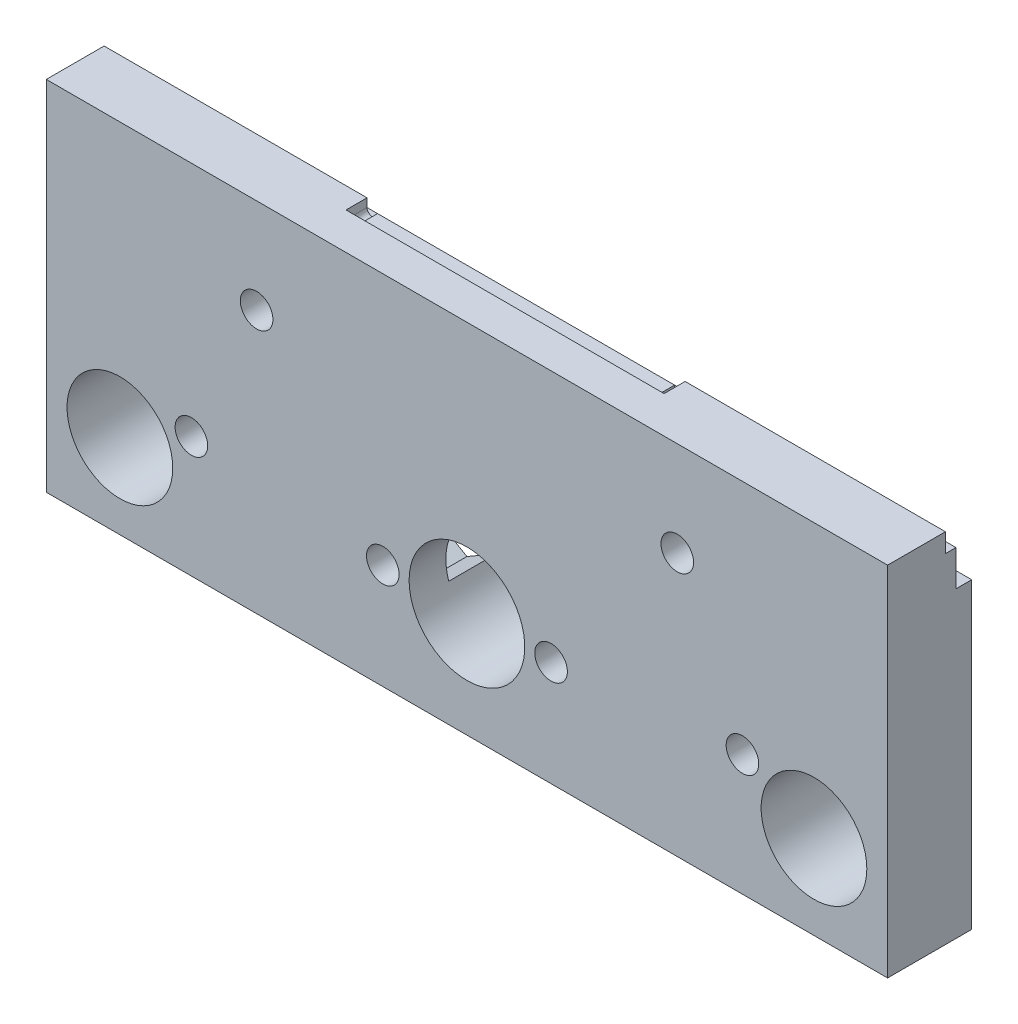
ISO-10303-21;
HEADER;
FILE_DESCRIPTION(('STEP AP214'),'2;1');
FILE_NAME('part.step','',(''),(''),'','','');
FILE_SCHEMA(('AUTOMOTIVE_DESIGN { 1 0 10303 214 1 1 1 1 }'));
ENDSEC;
DATA;
#1=APPLICATION_CONTEXT('core data for automotive mechanical design processes');
#2=APPLICATION_PROTOCOL_DEFINITION('international standard','automotive_design',2000,#1);
#3=PRODUCT_CONTEXT('',#1,'mechanical');
#4=PRODUCT('Part','Part','',(#3));
#5=PRODUCT_RELATED_PRODUCT_CATEGORY('part','',(#4));
#6=PRODUCT_DEFINITION_FORMATION('','',#4);
#7=PRODUCT_DEFINITION_CONTEXT('part definition',#1,'design');
#8=PRODUCT_DEFINITION('design','',#6,#7);
#9=PRODUCT_DEFINITION_SHAPE('','',#8);
#10=(LENGTH_UNIT() NAMED_UNIT(*) SI_UNIT(.MILLI.,.METRE.));
#11=(NAMED_UNIT(*) PLANE_ANGLE_UNIT() SI_UNIT($,.RADIAN.));
#12=(NAMED_UNIT(*) SI_UNIT($,.STERADIAN.) SOLID_ANGLE_UNIT());
#13=UNCERTAINTY_MEASURE_WITH_UNIT(LENGTH_MEASURE(1.E-05),#10,'distance_accuracy_value','');
#14=(GEOMETRIC_REPRESENTATION_CONTEXT(3) GLOBAL_UNCERTAINTY_ASSIGNED_CONTEXT((#13)) GLOBAL_UNIT_ASSIGNED_CONTEXT((#10,
#11,#12)) REPRESENTATION_CONTEXT('',''));
#15=CARTESIAN_POINT('',(0.,0.,0.));
#16=DIRECTION('',(0.,0.,1.));
#17=DIRECTION('',(1.,0.,0.));
#18=AXIS2_PLACEMENT_3D('',#15,#16,#17);
#19=CARTESIAN_POINT('',(32.,10.,0.));
#20=DIRECTION('',(0.,0.,1.));
#21=DIRECTION('',(1.,0.,0.));
#22=AXIS2_PLACEMENT_3D('',#19,#20,#21);
#23=CYLINDRICAL_SURFACE('',#22,1.55);
#24=CARTESIAN_POINT('',(32.,10.,8.));
#25=DIRECTION('',(0.,0.,1.));
#26=DIRECTION('',(1.,0.,0.));
#27=AXIS2_PLACEMENT_3D('',#24,#25,#26);
#28=CIRCLE('',#27,1.55);
#29=CARTESIAN_POINT('',(33.55,10.,8.));
#30=VERTEX_POINT('',#29);
#31=EDGE_CURVE('E259',#30,#30,#28,.T.);
#32=ORIENTED_EDGE('',*,*,#31,.T.);
#33=EDGE_LOOP('',(#32));
#34=FACE_BOUND('',#33,.T.);
#35=CARTESIAN_POINT('',(32.,10.,4.5));
#36=DIRECTION('',(0.,0.,-1.));
#37=DIRECTION('',(-1.,0.,0.));
#38=AXIS2_PLACEMENT_3D('',#35,#36,#37);
#39=CIRCLE('',#38,1.55);
#40=CARTESIAN_POINT('',(30.45,10.,4.5));
#41=VERTEX_POINT('',#40);
#42=EDGE_CURVE('E262',#41,#41,#39,.F.);
#43=ORIENTED_EDGE('',*,*,#42,.F.);
#44=EDGE_LOOP('',(#43));
#45=FACE_BOUND('',#44,.T.);
#46=ADVANCED_FACE('F33',(#34,#45),#23,.F.);
#47=CARTESIAN_POINT('',(48.,10.,0.));
#48=DIRECTION('',(0.,0.,1.));
#49=DIRECTION('',(1.,0.,0.));
#50=AXIS2_PLACEMENT_3D('',#47,#48,#49);
#51=CYLINDRICAL_SURFACE('',#50,1.55);
#52=CARTESIAN_POINT('',(48.,10.,8.));
#53=DIRECTION('',(0.,0.,1.));
#54=DIRECTION('',(1.,0.,0.));
#55=AXIS2_PLACEMENT_3D('',#52,#53,#54);
#56=CIRCLE('',#55,1.55);
#57=CARTESIAN_POINT('',(49.55,10.,8.));
#58=VERTEX_POINT('',#57);
#59=EDGE_CURVE('E255',#58,#58,#56,.T.);
#60=ORIENTED_EDGE('',*,*,#59,.T.);
#61=EDGE_LOOP('',(#60));
#62=FACE_BOUND('',#61,.T.);
#63=CARTESIAN_POINT('',(48.,10.,4.5));
#64=DIRECTION('',(0.,0.,-1.));
#65=DIRECTION('',(-1.,0.,0.));
#66=AXIS2_PLACEMENT_3D('',#63,#64,#65);
#67=CIRCLE('',#66,1.55);
#68=CARTESIAN_POINT('',(46.45,10.,4.5));
#69=VERTEX_POINT('',#68);
#70=EDGE_CURVE('E337',#69,#69,#67,.F.);
#71=ORIENTED_EDGE('',*,*,#70,.F.);
#72=EDGE_LOOP('',(#71));
#73=FACE_BOUND('',#72,.T.);
#74=ADVANCED_FACE('F346',(#62,#73),#51,.F.);
#75=CARTESIAN_POINT('',(0.,0.,8.));
#76=DIRECTION('',(0.,0.,1.));
#77=DIRECTION('',(1.,0.,0.));
#78=AXIS2_PLACEMENT_3D('',#75,#76,#77);
#79=PLANE('',#78);
#80=CARTESIAN_POINT('',(40.,10.,8.));
#81=DIRECTION('',(0.,0.,-1.));
#82=DIRECTION('',(-1.,0.,0.));
#83=AXIS2_PLACEMENT_3D('',#80,#81,#82);
#84=CIRCLE('',#83,5.5);
#85=CARTESIAN_POINT('',(34.5,10.,8.));
#86=VERTEX_POINT('',#85);
#87=EDGE_CURVE('E226',#86,#86,#84,.T.);
#88=ORIENTED_EDGE('',*,*,#87,.T.);
#89=EDGE_LOOP('',(#88));
#90=FACE_BOUND('',#89,.T.);
#91=CARTESIAN_POINT('',(66.2,11.4999999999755,8.));
#92=DIRECTION('',(0.,0.,-1.));
#93=DIRECTION('',(-1.,0.,0.));
#94=AXIS2_PLACEMENT_3D('',#91,#92,#93);
#95=CIRCLE('',#94,1.54999999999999);
#96=CARTESIAN_POINT('',(64.65,11.4999999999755,8.));
#97=VERTEX_POINT('',#96);
#98=EDGE_CURVE('E546',#97,#97,#95,.T.);
#99=ORIENTED_EDGE('',*,*,#98,.T.);
#100=EDGE_LOOP('',(#99));
#101=FACE_BOUND('',#100,.T.);
#102=CARTESIAN_POINT('',(13.8,11.4999999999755,8.));
#103=DIRECTION('',(0.,0.,-1.));
#104=DIRECTION('',(1.,0.,0.));
#105=AXIS2_PLACEMENT_3D('',#102,#103,#104);
#106=CIRCLE('',#105,1.54999999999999);
#107=CARTESIAN_POINT('',(15.35,11.4999999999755,8.));
#108=VERTEX_POINT('',#107);
#109=EDGE_CURVE('E541',#108,#108,#106,.T.);
#110=ORIENTED_EDGE('',*,*,#109,.T.);
#111=EDGE_LOOP('',(#110));
#112=FACE_BOUND('',#111,.T.);
#113=CARTESIAN_POINT('',(60.,25.,8.));
#114=DIRECTION('',(0.,0.,-1.));
#115=DIRECTION('',(-1.,0.,0.));
#116=AXIS2_PLACEMENT_3D('',#113,#114,#115);
#117=CIRCLE('',#116,1.55000000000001);
#118=CARTESIAN_POINT('',(58.45,25.,8.));
#119=VERTEX_POINT('',#118);
#120=EDGE_CURVE('E444',#119,#119,#117,.T.);
#121=ORIENTED_EDGE('',*,*,#120,.T.);
#122=EDGE_LOOP('',(#121));
#123=FACE_BOUND('',#122,.T.);
#124=CARTESIAN_POINT('',(20.,25.,8.));
#125=DIRECTION('',(0.,0.,-1.));
#126=DIRECTION('',(-1.,0.,0.));
#127=AXIS2_PLACEMENT_3D('',#124,#125,#126);
#128=CIRCLE('',#127,1.55);
#129=CARTESIAN_POINT('',(18.45,25.,8.));
#130=VERTEX_POINT('',#129);
#131=EDGE_CURVE('E450',#130,#130,#128,.T.);
#132=ORIENTED_EDGE('',*,*,#131,.T.);
#133=EDGE_LOOP('',(#132));
#134=FACE_BOUND('',#133,.T.);
#135=ORIENTED_EDGE('',*,*,#59,.F.);
#136=EDGE_LOOP('',(#135));
#137=FACE_BOUND('',#136,.T.);
#138=ORIENTED_EDGE('',*,*,#31,.F.);
#139=EDGE_LOOP('',(#138));
#140=FACE_BOUND('',#139,.T.);
#141=DIRECTION('',(0.,-1.,0.));
#142=VECTOR('',#141,1.);
#143=CARTESIAN_POINT('',(0.,34.,8.));
#144=LINE('',#143,#142);
#145=CARTESIAN_POINT('',(0.,34.,8.));
#146=VERTEX_POINT('',#145);
#147=CARTESIAN_POINT('',(0.,0.,8.));
#148=VERTEX_POINT('',#147);
#149=EDGE_CURVE('E311',#146,#148,#144,.T.);
#150=ORIENTED_EDGE('',*,*,#149,.T.);
#151=DIRECTION('',(1.,0.,0.));
#152=VECTOR('',#151,1.);
#153=CARTESIAN_POINT('',(0.,0.,8.));
#154=LINE('',#153,#152);
#155=CARTESIAN_POINT('',(80.,0.,8.));
#156=VERTEX_POINT('',#155);
#157=EDGE_CURVE('E314',#148,#156,#154,.T.);
#158=ORIENTED_EDGE('',*,*,#157,.T.);
#159=DIRECTION('',(0.,1.,0.));
#160=VECTOR('',#159,1.);
#161=CARTESIAN_POINT('',(80.,0.,8.));
#162=LINE('',#161,#160);
#163=CARTESIAN_POINT('',(80.,34.,8.));
#164=VERTEX_POINT('',#163);
#165=EDGE_CURVE('E317',#156,#164,#162,.T.);
#166=ORIENTED_EDGE('',*,*,#165,.T.);
#167=DIRECTION('',(-1.,0.,0.));
#168=VECTOR('',#167,1.);
#169=CARTESIAN_POINT('',(80.,34.,8.));
#170=LINE('',#169,#168);
#171=EDGE_CURVE('E319',#164,#146,#170,.T.);
#172=ORIENTED_EDGE('',*,*,#171,.T.);
#173=EDGE_LOOP('',(#150,#158,#166,#172));
#174=FACE_BOUND('',#173,.T.);
#175=CARTESIAN_POINT('',(7.,8.,8.));
#176=DIRECTION('',(0.,0.,1.));
#177=DIRECTION('',(1.,0.,0.));
#178=AXIS2_PLACEMENT_3D('',#175,#176,#177);
#179=CIRCLE('',#178,5.025);
#180=CARTESIAN_POINT('',(12.025,8.,8.));
#181=VERTEX_POINT('',#180);
#182=EDGE_CURVE('E305',#181,#181,#179,.T.);
#183=ORIENTED_EDGE('',*,*,#182,.F.);
#184=EDGE_LOOP('',(#183));
#185=FACE_BOUND('',#184,.T.);
#186=CARTESIAN_POINT('',(73.,8.,8.));
#187=DIRECTION('',(0.,0.,1.));
#188=DIRECTION('',(1.,0.,0.));
#189=AXIS2_PLACEMENT_3D('',#186,#187,#188);
#190=CIRCLE('',#189,5.025);
#191=CARTESIAN_POINT('',(78.025,8.,8.));
#192=VERTEX_POINT('',#191);
#193=EDGE_CURVE('E299',#192,#192,#190,.T.);
#194=ORIENTED_EDGE('',*,*,#193,.F.);
#195=EDGE_LOOP('',(#194));
#196=FACE_BOUND('',#195,.T.);
#197=ADVANCED_FACE('F352',(#90,#101,#112,#123,#134,#137,#140,#174,#185,#196),#79,.T.);
#198=CARTESIAN_POINT('',(0.,0.,0.));
#199=DIRECTION('',(0.,0.,1.));
#200=DIRECTION('',(1.,0.,0.));
#201=AXIS2_PLACEMENT_3D('',#198,#199,#200);
#202=PLANE('',#201);
#203=CARTESIAN_POINT('',(66.2,11.4999999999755,0.));
#204=DIRECTION('',(0.,0.,-1.));
#205=DIRECTION('',(-1.,0.,0.));
#206=AXIS2_PLACEMENT_3D('',#203,#204,#205);
#207=CIRCLE('',#206,1.54999999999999);
#208=CARTESIAN_POINT('',(64.65,11.4999999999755,0.));
#209=VERTEX_POINT('',#208);
#210=EDGE_CURVE('E550',#209,#209,#207,.T.);
#211=ORIENTED_EDGE('',*,*,#210,.F.);
#212=EDGE_LOOP('',(#211));
#213=FACE_BOUND('',#212,.T.);
#214=CARTESIAN_POINT('',(13.8,11.4999999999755,0.));
#215=DIRECTION('',(0.,0.,-1.));
#216=DIRECTION('',(1.,0.,0.));
#217=AXIS2_PLACEMENT_3D('',#214,#215,#216);
#218=CIRCLE('',#217,1.54999999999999);
#219=CARTESIAN_POINT('',(15.35,11.4999999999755,0.));
#220=VERTEX_POINT('',#219);
#221=EDGE_CURVE('E537',#220,#220,#218,.T.);
#222=ORIENTED_EDGE('',*,*,#221,.F.);
#223=EDGE_LOOP('',(#222));
#224=FACE_BOUND('',#223,.T.);
#225=CARTESIAN_POINT('',(60.,25.,0.));
#226=DIRECTION('',(0.,0.,-1.));
#227=DIRECTION('',(-1.,0.,0.));
#228=AXIS2_PLACEMENT_3D('',#225,#226,#227);
#229=CIRCLE('',#228,1.55000000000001);
#230=CARTESIAN_POINT('',(58.45,25.,0.));
#231=VERTEX_POINT('',#230);
#232=EDGE_CURVE('E447',#231,#231,#229,.T.);
#233=ORIENTED_EDGE('',*,*,#232,.F.);
#234=EDGE_LOOP('',(#233));
#235=FACE_BOUND('',#234,.T.);
#236=CARTESIAN_POINT('',(20.,25.,0.));
#237=DIRECTION('',(0.,0.,-1.));
#238=DIRECTION('',(-1.,0.,0.));
#239=AXIS2_PLACEMENT_3D('',#236,#237,#238);
#240=CIRCLE('',#239,1.55);
#241=CARTESIAN_POINT('',(18.45,25.,0.));
#242=VERTEX_POINT('',#241);
#243=EDGE_CURVE('E453',#242,#242,#240,.T.);
#244=ORIENTED_EDGE('',*,*,#243,.F.);
#245=EDGE_LOOP('',(#244));
#246=FACE_BOUND('',#245,.T.);
#247=DIRECTION('',(0.866025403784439,0.5,0.));
#248=VECTOR('',#247,1.);
#249=CARTESIAN_POINT('',(45.15,11.6454482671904,0.));
#250=LINE('',#249,#248);
#251=CARTESIAN_POINT('',(45.2328562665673,11.6932853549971,0.));
#252=VERTEX_POINT('',#251);
#253=CARTESIAN_POINT('',(48.,13.2908965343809,0.));
#254=VERTEX_POINT('',#253);
#255=EDGE_CURVE('E225',#252,#254,#250,.T.);
#256=ORIENTED_EDGE('',*,*,#255,.F.);
#257=CARTESIAN_POINT('',(40.,10.,0.));
#258=DIRECTION('',(0.,0.,-1.));
#259=DIRECTION('',(-1.,0.,0.));
#260=AXIS2_PLACEMENT_3D('',#257,#258,#259);
#261=CIRCLE('',#260,5.5);
#262=CARTESIAN_POINT('',(34.7671437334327,11.6932853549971,0.));
#263=VERTEX_POINT('',#262);
#264=EDGE_CURVE('E207',#263,#252,#261,.T.);
#265=ORIENTED_EDGE('',*,*,#264,.F.);
#266=DIRECTION('',(0.866025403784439,-0.499999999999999,0.));
#267=VECTOR('',#266,1.);
#268=CARTESIAN_POINT('',(32.,13.2908965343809,0.));
#269=LINE('',#268,#267);
#270=CARTESIAN_POINT('',(32.,13.2908965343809,0.));
#271=VERTEX_POINT('',#270);
#272=EDGE_CURVE('E223',#271,#263,#269,.T.);
#273=ORIENTED_EDGE('',*,*,#272,.F.);
#274=DIRECTION('',(0.866025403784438,0.500000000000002,0.));
#275=VECTOR('',#274,1.);
#276=CARTESIAN_POINT('',(29.15,11.6454482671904,0.));
#277=LINE('',#276,#275);
#278=CARTESIAN_POINT('',(29.15,11.6454482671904,0.));
#279=VERTEX_POINT('',#278);
#280=EDGE_CURVE('E254',#279,#271,#277,.T.);
#281=ORIENTED_EDGE('',*,*,#280,.F.);
#282=DIRECTION('',(0.,1.,0.));
#283=VECTOR('',#282,1.);
#284=CARTESIAN_POINT('',(29.15,8.35455173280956,0.));
#285=LINE('',#284,#283);
#286=CARTESIAN_POINT('',(29.15,8.35455173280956,0.));
#287=VERTEX_POINT('',#286);
#288=EDGE_CURVE('E497',#287,#279,#285,.T.);
#289=ORIENTED_EDGE('',*,*,#288,.F.);
#290=DIRECTION('',(-0.866025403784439,0.499999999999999,0.));
#291=VECTOR('',#290,1.);
#292=CARTESIAN_POINT('',(32.,6.70910346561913,0.));
#293=LINE('',#292,#291);
#294=CARTESIAN_POINT('',(32.,6.70910346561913,0.));
#295=VERTEX_POINT('',#294);
#296=EDGE_CURVE('E236',#295,#287,#293,.T.);
#297=ORIENTED_EDGE('',*,*,#296,.F.);
#298=DIRECTION('',(-0.866025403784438,-0.500000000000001,0.));
#299=VECTOR('',#298,1.);
#300=CARTESIAN_POINT('',(34.85,8.35455173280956,0.));
#301=LINE('',#300,#299);
#302=CARTESIAN_POINT('',(34.7671437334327,8.3067146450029,0.));
#303=VERTEX_POINT('',#302);
#304=EDGE_CURVE('E232',#303,#295,#301,.T.);
#305=ORIENTED_EDGE('',*,*,#304,.F.);
#306=CARTESIAN_POINT('',(45.2328562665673,8.30671464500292,0.));
#307=VERTEX_POINT('',#306);
#308=EDGE_CURVE('E48',#307,#303,#261,.T.);
#309=ORIENTED_EDGE('',*,*,#308,.F.);
#310=DIRECTION('',(-0.866025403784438,0.5,0.));
#311=VECTOR('',#310,1.);
#312=CARTESIAN_POINT('',(48.,6.70910346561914,0.));
#313=LINE('',#312,#311);
#314=CARTESIAN_POINT('',(48.,6.70910346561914,0.));
#315=VERTEX_POINT('',#314);
#316=EDGE_CURVE('E477',#315,#307,#313,.T.);
#317=ORIENTED_EDGE('',*,*,#316,.F.);
#318=DIRECTION('',(-0.866025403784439,-0.5,0.));
#319=VECTOR('',#318,1.);
#320=CARTESIAN_POINT('',(50.85,8.35455173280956,0.));
#321=LINE('',#320,#319);
#322=CARTESIAN_POINT('',(50.85,8.35455173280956,0.));
#323=VERTEX_POINT('',#322);
#324=EDGE_CURVE('E474',#323,#315,#321,.T.);
#325=ORIENTED_EDGE('',*,*,#324,.F.);
#326=DIRECTION('',(0.,-1.,0.));
#327=VECTOR('',#326,1.);
#328=CARTESIAN_POINT('',(50.85,11.6454482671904,0.));
#329=LINE('',#328,#327);
#330=CARTESIAN_POINT('',(50.85,11.6454482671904,0.));
#331=VERTEX_POINT('',#330);
#332=EDGE_CURVE('E234',#331,#323,#329,.T.);
#333=ORIENTED_EDGE('',*,*,#332,.F.);
#334=DIRECTION('',(0.866025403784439,-0.5,0.));
#335=VECTOR('',#334,1.);
#336=CARTESIAN_POINT('',(48.,13.2908965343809,0.));
#337=LINE('',#336,#335);
#338=EDGE_CURVE('E231',#254,#331,#337,.T.);
#339=ORIENTED_EDGE('',*,*,#338,.F.);
#340=EDGE_LOOP('',(#256,#265,#273,#281,#289,#297,#305,#309,#317,#325,#333,#339));
#341=FACE_BOUND('',#340,.T.);
#342=DIRECTION('',(0.,-1.,0.));
#343=VECTOR('',#342,1.);
#344=CARTESIAN_POINT('',(0.,34.,0.));
#345=LINE('',#344,#343);
#346=CARTESIAN_POINT('',(0.,28.7999999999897,0.));
#347=VERTEX_POINT('',#346);
#348=CARTESIAN_POINT('',(0.,0.,0.));
#349=VERTEX_POINT('',#348);
#350=EDGE_CURVE('E308',#347,#349,#345,.T.);
#351=ORIENTED_EDGE('',*,*,#350,.F.);
#352=DIRECTION('',(1.,0.,0.));
#353=VECTOR('',#352,1.);
#354=CARTESIAN_POINT('',(0.,28.7999999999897,0.));
#355=LINE('',#354,#353);
#356=CARTESIAN_POINT('',(80.,28.7999999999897,0.));
#357=VERTEX_POINT('',#356);
#358=EDGE_CURVE('E286',#347,#357,#355,.T.);
#359=ORIENTED_EDGE('',*,*,#358,.T.);
#360=DIRECTION('',(0.,1.,0.));
#361=VECTOR('',#360,1.);
#362=CARTESIAN_POINT('',(80.,0.,0.));
#363=LINE('',#362,#361);
#364=CARTESIAN_POINT('',(80.,0.,0.));
#365=VERTEX_POINT('',#364);
#366=EDGE_CURVE('E315',#365,#357,#363,.T.);
#367=ORIENTED_EDGE('',*,*,#366,.F.);
#368=DIRECTION('',(1.,0.,0.));
#369=VECTOR('',#368,1.);
#370=CARTESIAN_POINT('',(0.,0.,0.));
#371=LINE('',#370,#369);
#372=EDGE_CURVE('E323',#349,#365,#371,.T.);
#373=ORIENTED_EDGE('',*,*,#372,.F.);
#374=EDGE_LOOP('',(#351,#359,#367,#373));
#375=FACE_BOUND('',#374,.T.);
#376=CARTESIAN_POINT('',(7.,8.,0.));
#377=DIRECTION('',(0.,0.,1.));
#378=DIRECTION('',(1.,0.,0.));
#379=AXIS2_PLACEMENT_3D('',#376,#377,#378);
#380=CIRCLE('',#379,5.025);
#381=CARTESIAN_POINT('',(12.025,8.,0.));
#382=VERTEX_POINT('',#381);
#383=EDGE_CURVE('E302',#382,#382,#380,.T.);
#384=ORIENTED_EDGE('',*,*,#383,.T.);
#385=EDGE_LOOP('',(#384));
#386=FACE_BOUND('',#385,.T.);
#387=CARTESIAN_POINT('',(73.,8.,0.));
#388=DIRECTION('',(0.,0.,1.));
#389=DIRECTION('',(1.,0.,0.));
#390=AXIS2_PLACEMENT_3D('',#387,#388,#389);
#391=CIRCLE('',#390,5.025);
#392=CARTESIAN_POINT('',(78.025,8.,0.));
#393=VERTEX_POINT('',#392);
#394=EDGE_CURVE('E289',#393,#393,#391,.T.);
#395=ORIENTED_EDGE('',*,*,#394,.T.);
#396=EDGE_LOOP('',(#395));
#397=FACE_BOUND('',#396,.T.);
#398=ADVANCED_FACE('F220',(#213,#224,#235,#246,#341,#375,#386,#397),#202,.F.);
#399=CARTESIAN_POINT('',(0.,34.,8.));
#400=DIRECTION('',(1.,0.,0.));
#401=DIRECTION('',(0.,0.,-1.));
#402=AXIS2_PLACEMENT_3D('',#399,#400,#401);
#403=PLANE('',#402);
#404=DIRECTION('',(0.,-1.,0.));
#405=VECTOR('',#404,1.);
#406=CARTESIAN_POINT('',(0.,32.2,1.5));
#407=LINE('',#406,#405);
#408=CARTESIAN_POINT('',(0.,32.2,1.5));
#409=VERTEX_POINT('',#408);
#410=CARTESIAN_POINT('',(0.,28.8,1.5));
#411=VERTEX_POINT('',#410);
#412=EDGE_CURVE('E270',#409,#411,#407,.T.);
#413=ORIENTED_EDGE('',*,*,#412,.T.);
#414=DIRECTION('',(0.,-6.85562717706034E-12,-1.));
#415=VECTOR('',#414,1.);
#416=CARTESIAN_POINT('',(0.,28.8,1.5));
#417=LINE('',#416,#415);
#418=EDGE_CURVE('E273',#411,#347,#417,.T.);
#419=ORIENTED_EDGE('',*,*,#418,.T.);
#420=ORIENTED_EDGE('',*,*,#350,.T.);
#421=DIRECTION('',(0.,0.,-1.));
#422=VECTOR('',#421,1.);
#423=CARTESIAN_POINT('',(0.,0.,8.));
#424=LINE('',#423,#422);
#425=EDGE_CURVE('E41',#148,#349,#424,.T.);
#426=ORIENTED_EDGE('',*,*,#425,.F.);
#427=ORIENTED_EDGE('',*,*,#149,.F.);
#428=DIRECTION('',(0.,0.,-1.));
#429=VECTOR('',#428,1.);
#430=CARTESIAN_POINT('',(0.,34.,8.));
#431=LINE('',#430,#429);
#432=CARTESIAN_POINT('',(0.,34.,2.5));
#433=VERTEX_POINT('',#432);
#434=EDGE_CURVE('E321',#146,#433,#431,.T.);
#435=ORIENTED_EDGE('',*,*,#434,.T.);
#436=DIRECTION('',(0.,-1.,0.));
#437=VECTOR('',#436,1.);
#438=CARTESIAN_POINT('',(0.,32.2,2.5));
#439=LINE('',#438,#437);
#440=CARTESIAN_POINT('',(0.,32.2,2.5));
#441=VERTEX_POINT('',#440);
#442=EDGE_CURVE('E263',#433,#441,#439,.T.);
#443=ORIENTED_EDGE('',*,*,#442,.T.);
#444=DIRECTION('',(0.,0.,-1.));
#445=VECTOR('',#444,1.);
#446=CARTESIAN_POINT('',(0.,32.2,1.5));
#447=LINE('',#446,#445);
#448=EDGE_CURVE('E266',#441,#409,#447,.T.);
#449=ORIENTED_EDGE('',*,*,#448,.T.);
#450=EDGE_LOOP('',(#413,#419,#420,#426,#427,#435,#443,#449));
#451=FACE_BOUND('',#450,.T.);
#452=ADVANCED_FACE('F35',(#451),#403,.F.);
#453=CARTESIAN_POINT('',(0.,0.,8.));
#454=DIRECTION('',(0.,1.,0.));
#455=DIRECTION('',(0.,0.,1.));
#456=AXIS2_PLACEMENT_3D('',#453,#454,#455);
#457=PLANE('',#456);
#458=ORIENTED_EDGE('',*,*,#372,.T.);
#459=DIRECTION('',(0.,0.,-1.));
#460=VECTOR('',#459,1.);
#461=CARTESIAN_POINT('',(80.,0.,8.));
#462=LINE('',#461,#460);
#463=EDGE_CURVE('E332',#156,#365,#462,.T.);
#464=ORIENTED_EDGE('',*,*,#463,.F.);
#465=ORIENTED_EDGE('',*,*,#157,.F.);
#466=ORIENTED_EDGE('',*,*,#425,.T.);
#467=EDGE_LOOP('',(#458,#464,#465,#466));
#468=FACE_BOUND('',#467,.T.);
#469=ADVANCED_FACE('F394',(#468),#457,.F.);
#470=CARTESIAN_POINT('',(80.,0.,8.));
#471=DIRECTION('',(-1.,0.,0.));
#472=DIRECTION('',(0.,0.,1.));
#473=AXIS2_PLACEMENT_3D('',#470,#471,#472);
#474=PLANE('',#473);
#475=ORIENTED_EDGE('',*,*,#366,.T.);
#476=DIRECTION('',(0.,-6.85562717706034E-12,-1.));
#477=VECTOR('',#476,1.);
#478=CARTESIAN_POINT('',(80.,28.8,1.5));
#479=LINE('',#478,#477);
#480=CARTESIAN_POINT('',(80.,28.8,1.5));
#481=VERTEX_POINT('',#480);
#482=EDGE_CURVE('E267',#481,#357,#479,.T.);
#483=ORIENTED_EDGE('',*,*,#482,.F.);
#484=DIRECTION('',(0.,-1.,0.));
#485=VECTOR('',#484,1.);
#486=CARTESIAN_POINT('',(80.,32.2,1.5));
#487=LINE('',#486,#485);
#488=CARTESIAN_POINT('',(80.,32.2,1.5));
#489=VERTEX_POINT('',#488);
#490=EDGE_CURVE('E282',#489,#481,#487,.T.);
#491=ORIENTED_EDGE('',*,*,#490,.F.);
#492=DIRECTION('',(0.,0.,-1.));
#493=VECTOR('',#492,1.);
#494=CARTESIAN_POINT('',(80.,32.2,1.5));
#495=LINE('',#494,#493);
#496=CARTESIAN_POINT('',(80.,32.2,2.5));
#497=VERTEX_POINT('',#496);
#498=EDGE_CURVE('E279',#497,#489,#495,.T.);
#499=ORIENTED_EDGE('',*,*,#498,.F.);
#500=DIRECTION('',(0.,-1.,0.));
#501=VECTOR('',#500,1.);
#502=CARTESIAN_POINT('',(80.,32.2,2.5));
#503=LINE('',#502,#501);
#504=CARTESIAN_POINT('',(80.,34.,2.5));
#505=VERTEX_POINT('',#504);
#506=EDGE_CURVE('E258',#505,#497,#503,.T.);
#507=ORIENTED_EDGE('',*,*,#506,.F.);
#508=DIRECTION('',(0.,0.,-1.));
#509=VECTOR('',#508,1.);
#510=CARTESIAN_POINT('',(80.,34.,8.));
#511=LINE('',#510,#509);
#512=EDGE_CURVE('E329',#164,#505,#511,.T.);
#513=ORIENTED_EDGE('',*,*,#512,.F.);
#514=ORIENTED_EDGE('',*,*,#165,.F.);
#515=ORIENTED_EDGE('',*,*,#463,.T.);
#516=EDGE_LOOP('',(#475,#483,#491,#499,#507,#513,#514,#515));
#517=FACE_BOUND('',#516,.T.);
#518=ADVANCED_FACE('F391',(#517),#474,.F.);
#519=CARTESIAN_POINT('',(80.,34.,8.));
#520=DIRECTION('',(0.,-1.,0.));
#521=DIRECTION('',(1.,0.,0.));
#522=AXIS2_PLACEMENT_3D('',#519,#520,#521);
#523=PLANE('',#522);
#524=DIRECTION('',(1.,0.,0.));
#525=VECTOR('',#524,1.);
#526=CARTESIAN_POINT('',(25.000000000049,34.,4.49999999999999));
#527=LINE('',#526,#525);
#528=CARTESIAN_POINT('',(25.000000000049,34.,4.49999999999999));
#529=VERTEX_POINT('',#528);
#530=CARTESIAN_POINT('',(55.247938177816,34.,4.49999999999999));
#531=VERTEX_POINT('',#530);
#532=EDGE_CURVE('E431',#529,#531,#527,.T.);
#533=ORIENTED_EDGE('',*,*,#532,.F.);
#534=DIRECTION('',(0.,0.,-1.));
#535=VECTOR('',#534,1.);
#536=CARTESIAN_POINT('',(25.000000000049,34.,4.49999999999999));
#537=LINE('',#536,#535);
#538=CARTESIAN_POINT('',(25.000000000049,34.,2.49999999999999));
#539=VERTEX_POINT('',#538);
#540=EDGE_CURVE('E429',#529,#539,#537,.T.);
#541=ORIENTED_EDGE('',*,*,#540,.T.);
#542=DIRECTION('',(1.,0.,0.));
#543=VECTOR('',#542,1.);
#544=CARTESIAN_POINT('',(0.,34.,2.5));
#545=LINE('',#544,#543);
#546=EDGE_CURVE('E296',#433,#539,#545,.T.);
#547=ORIENTED_EDGE('',*,*,#546,.F.);
#548=ORIENTED_EDGE('',*,*,#434,.F.);
#549=ORIENTED_EDGE('',*,*,#171,.F.);
#550=ORIENTED_EDGE('',*,*,#512,.T.);
#551=CARTESIAN_POINT('',(55.247938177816,34.,2.5));
#552=VERTEX_POINT('',#551);
#553=EDGE_CURVE('E276',#552,#505,#545,.T.);
#554=ORIENTED_EDGE('',*,*,#553,.F.);
#555=DIRECTION('',(0.,0.,-1.));
#556=VECTOR('',#555,1.);
#557=CARTESIAN_POINT('',(55.247938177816,34.,4.49999999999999));
#558=LINE('',#557,#556);
#559=EDGE_CURVE('E55',#531,#552,#558,.T.);
#560=ORIENTED_EDGE('',*,*,#559,.F.);
#561=EDGE_LOOP('',(#533,#541,#547,#548,#549,#550,#554,#560));
#562=FACE_BOUND('',#561,.T.);
#563=ADVANCED_FACE('F381',(#562),#523,.F.);
#564=CARTESIAN_POINT('',(7.,8.,8.));
#565=DIRECTION('',(0.,0.,-1.));
#566=DIRECTION('',(-1.,0.,0.));
#567=AXIS2_PLACEMENT_3D('',#564,#565,#566);
#568=CYLINDRICAL_SURFACE('',#567,5.025);
#569=ORIENTED_EDGE('',*,*,#182,.T.);
#570=EDGE_LOOP('',(#569));
#571=FACE_BOUND('',#570,.T.);
#572=ORIENTED_EDGE('',*,*,#383,.F.);
#573=EDGE_LOOP('',(#572));
#574=FACE_BOUND('',#573,.T.);
#575=ADVANCED_FACE('F377',(#571,#574),#568,.F.);
#576=CARTESIAN_POINT('',(73.,8.,8.));
#577=DIRECTION('',(0.,0.,-1.));
#578=DIRECTION('',(-1.,0.,0.));
#579=AXIS2_PLACEMENT_3D('',#576,#577,#578);
#580=CYLINDRICAL_SURFACE('',#579,5.025);
#581=ORIENTED_EDGE('',*,*,#193,.T.);
#582=EDGE_LOOP('',(#581));
#583=FACE_BOUND('',#582,.T.);
#584=ORIENTED_EDGE('',*,*,#394,.F.);
#585=EDGE_LOOP('',(#584));
#586=FACE_BOUND('',#585,.T.);
#587=ADVANCED_FACE('F361',(#583,#586),#580,.F.);
#588=CARTESIAN_POINT('',(0.,28.8,1.5));
#589=DIRECTION('',(0.,-1.,6.85562717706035E-12));
#590=DIRECTION('',(0.,-6.85562717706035E-12,-1.));
#591=AXIS2_PLACEMENT_3D('',#588,#589,#590);
#592=PLANE('',#591);
#593=ORIENTED_EDGE('',*,*,#482,.T.);
#594=ORIENTED_EDGE('',*,*,#358,.F.);
#595=ORIENTED_EDGE('',*,*,#418,.F.);
#596=DIRECTION('',(1.,0.,0.));
#597=VECTOR('',#596,1.);
#598=CARTESIAN_POINT('',(0.,28.8,1.5));
#599=LINE('',#598,#597);
#600=EDGE_CURVE('E290',#411,#481,#599,.T.);
#601=ORIENTED_EDGE('',*,*,#600,.T.);
#602=EDGE_LOOP('',(#593,#594,#595,#601));
#603=FACE_BOUND('',#602,.T.);
#604=ADVANCED_FACE('F357',(#603),#592,.F.);
#605=CARTESIAN_POINT('',(0.,32.2,1.5));
#606=DIRECTION('',(0.,0.,1.));
#607=DIRECTION('',(0.,-1.,0.));
#608=AXIS2_PLACEMENT_3D('',#605,#606,#607);
#609=PLANE('',#608);
#610=ORIENTED_EDGE('',*,*,#490,.T.);
#611=ORIENTED_EDGE('',*,*,#600,.F.);
#612=ORIENTED_EDGE('',*,*,#412,.F.);
#613=DIRECTION('',(1.,0.,0.));
#614=VECTOR('',#613,1.);
#615=CARTESIAN_POINT('',(0.,32.2,1.5));
#616=LINE('',#615,#614);
#617=EDGE_CURVE('E292',#409,#489,#616,.T.);
#618=ORIENTED_EDGE('',*,*,#617,.T.);
#619=EDGE_LOOP('',(#610,#611,#612,#618));
#620=FACE_BOUND('',#619,.T.);
#621=ADVANCED_FACE('F360',(#620),#609,.F.);
#622=CARTESIAN_POINT('',(0.,32.2,1.5));
#623=DIRECTION('',(0.,-1.,0.));
#624=DIRECTION('',(0.,0.,-1.));
#625=AXIS2_PLACEMENT_3D('',#622,#623,#624);
#626=PLANE('',#625);
#627=ORIENTED_EDGE('',*,*,#498,.T.);
#628=ORIENTED_EDGE('',*,*,#617,.F.);
#629=ORIENTED_EDGE('',*,*,#448,.F.);
#630=DIRECTION('',(1.,0.,0.));
#631=VECTOR('',#630,1.);
#632=CARTESIAN_POINT('',(0.,32.2,2.5));
#633=LINE('',#632,#631);
#634=EDGE_CURVE('E294',#441,#497,#633,.T.);
#635=ORIENTED_EDGE('',*,*,#634,.T.);
#636=EDGE_LOOP('',(#627,#628,#629,#635));
#637=FACE_BOUND('',#636,.T.);
#638=ADVANCED_FACE('F365',(#637),#626,.F.);
#639=CARTESIAN_POINT('',(0.,32.2,2.5));
#640=DIRECTION('',(0.,0.,1.));
#641=DIRECTION('',(0.,-1.,0.));
#642=AXIS2_PLACEMENT_3D('',#639,#640,#641);
#643=PLANE('',#642);
#644=ORIENTED_EDGE('',*,*,#546,.T.);
#645=DIRECTION('',(0.,1.,0.));
#646=VECTOR('',#645,1.);
#647=CARTESIAN_POINT('',(25.000000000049,34.,2.49999999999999));
#648=LINE('',#647,#646);
#649=CARTESIAN_POINT('',(25.000000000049,33.2,2.49999999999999));
#650=VERTEX_POINT('',#649);
#651=EDGE_CURVE('E549',#650,#539,#648,.T.);
#652=ORIENTED_EDGE('',*,*,#651,.F.);
#653=CARTESIAN_POINT('',(25.500000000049,33.2,2.49999999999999));
#654=DIRECTION('',(0.,0.,-1.));
#655=DIRECTION('',(-1.,0.,0.));
#656=AXIS2_PLACEMENT_3D('',#653,#654,#655);
#657=CIRCLE('',#656,0.500000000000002);
#658=CARTESIAN_POINT('',(26.000000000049,33.2,2.49999999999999));
#659=VERTEX_POINT('',#658);
#660=EDGE_CURVE('E557',#659,#650,#657,.T.);
#661=ORIENTED_EDGE('',*,*,#660,.F.);
#662=DIRECTION('',(-1.,0.,0.));
#663=VECTOR('',#662,1.);
#664=CARTESIAN_POINT('',(26.000000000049,33.2,2.49999999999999));
#665=LINE('',#664,#663);
#666=CARTESIAN_POINT('',(54.247938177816,33.2,2.49999999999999));
#667=VERTEX_POINT('',#666);
#668=EDGE_CURVE('E572',#667,#659,#665,.T.);
#669=ORIENTED_EDGE('',*,*,#668,.F.);
#670=CARTESIAN_POINT('',(54.747938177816,33.2,2.49999999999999));
#671=DIRECTION('',(0.,0.,-1.));
#672=DIRECTION('',(-1.,0.,0.));
#673=AXIS2_PLACEMENT_3D('',#670,#671,#672);
#674=CIRCLE('',#673,0.5);
#675=CARTESIAN_POINT('',(55.247938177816,33.2,2.49999999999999));
#676=VERTEX_POINT('',#675);
#677=EDGE_CURVE('E569',#676,#667,#674,.T.);
#678=ORIENTED_EDGE('',*,*,#677,.F.);
#679=DIRECTION('',(0.,-1.,0.));
#680=VECTOR('',#679,1.);
#681=CARTESIAN_POINT('',(55.247938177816,34.,2.49999999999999));
#682=LINE('',#681,#680);
#683=EDGE_CURVE('E419',#552,#676,#682,.T.);
#684=ORIENTED_EDGE('',*,*,#683,.F.);
#685=ORIENTED_EDGE('',*,*,#553,.T.);
#686=ORIENTED_EDGE('',*,*,#506,.T.);
#687=ORIENTED_EDGE('',*,*,#634,.F.);
#688=ORIENTED_EDGE('',*,*,#442,.F.);
#689=EDGE_LOOP('',(#644,#652,#661,#669,#678,#684,#685,#686,#687,#688));
#690=FACE_BOUND('',#689,.T.);
#691=ADVANCED_FACE('F369',(#690),#643,.F.);
#692=CARTESIAN_POINT('',(0.,0.,4.5));
#693=DIRECTION('',(0.,0.,-1.));
#694=DIRECTION('',(-1.,0.,0.));
#695=AXIS2_PLACEMENT_3D('',#692,#693,#694);
#696=PLANE('',#695);
#697=CARTESIAN_POINT('',(40.,10.,4.5));
#698=DIRECTION('',(0.,0.,-1.));
#699=DIRECTION('',(-1.,0.,0.));
#700=AXIS2_PLACEMENT_3D('',#697,#698,#699);
#701=CIRCLE('',#700,5.5);
#702=CARTESIAN_POINT('',(45.2328562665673,11.6932853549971,4.5));
#703=VERTEX_POINT('',#702);
#704=CARTESIAN_POINT('',(45.2328562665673,8.30671464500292,4.5));
#705=VERTEX_POINT('',#704);
#706=EDGE_CURVE('E538',#703,#705,#701,.T.);
#707=ORIENTED_EDGE('',*,*,#706,.F.);
#708=DIRECTION('',(0.866025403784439,0.5,0.));
#709=VECTOR('',#708,1.);
#710=CARTESIAN_POINT('',(45.15,11.6454482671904,4.5));
#711=LINE('',#710,#709);
#712=CARTESIAN_POINT('',(48.,13.2908965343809,4.5));
#713=VERTEX_POINT('',#712);
#714=EDGE_CURVE('E469',#703,#713,#711,.T.);
#715=ORIENTED_EDGE('',*,*,#714,.T.);
#716=DIRECTION('',(0.866025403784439,-0.5,0.));
#717=VECTOR('',#716,1.);
#718=CARTESIAN_POINT('',(48.,13.2908965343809,4.5));
#719=LINE('',#718,#717);
#720=CARTESIAN_POINT('',(50.85,11.6454482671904,4.5));
#721=VERTEX_POINT('',#720);
#722=EDGE_CURVE('E457',#713,#721,#719,.T.);
#723=ORIENTED_EDGE('',*,*,#722,.T.);
#724=DIRECTION('',(0.,-1.,0.));
#725=VECTOR('',#724,1.);
#726=CARTESIAN_POINT('',(50.85,11.6454482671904,4.5));
#727=LINE('',#726,#725);
#728=CARTESIAN_POINT('',(50.85,8.35455173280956,4.5));
#729=VERTEX_POINT('',#728);
#730=EDGE_CURVE('E460',#721,#729,#727,.T.);
#731=ORIENTED_EDGE('',*,*,#730,.T.);
#732=DIRECTION('',(-0.866025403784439,-0.5,0.));
#733=VECTOR('',#732,1.);
#734=CARTESIAN_POINT('',(50.85,8.35455173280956,4.5));
#735=LINE('',#734,#733);
#736=CARTESIAN_POINT('',(48.,6.70910346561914,4.5));
#737=VERTEX_POINT('',#736);
#738=EDGE_CURVE('E463',#729,#737,#735,.T.);
#739=ORIENTED_EDGE('',*,*,#738,.T.);
#740=DIRECTION('',(-0.866025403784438,0.5,0.));
#741=VECTOR('',#740,1.);
#742=CARTESIAN_POINT('',(48.,6.70910346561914,4.5));
#743=LINE('',#742,#741);
#744=EDGE_CURVE('E466',#737,#705,#743,.T.);
#745=ORIENTED_EDGE('',*,*,#744,.T.);
#746=EDGE_LOOP('',(#707,#715,#723,#731,#739,#745));
#747=FACE_BOUND('',#746,.T.);
#748=ORIENTED_EDGE('',*,*,#70,.T.);
#749=EDGE_LOOP('',(#748));
#750=FACE_BOUND('',#749,.T.);
#751=ADVANCED_FACE('F373',(#747,#750),#696,.T.);
#752=CARTESIAN_POINT('',(48.,13.2908965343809,4.5));
#753=DIRECTION('',(0.5,0.866025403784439,0.));
#754=DIRECTION('',(-0.866025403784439,0.5,0.));
#755=AXIS2_PLACEMENT_3D('',#752,#753,#754);
#756=PLANE('',#755);
#757=ORIENTED_EDGE('',*,*,#338,.T.);
#758=DIRECTION('',(0.,0.,-1.));
#759=VECTOR('',#758,1.);
#760=CARTESIAN_POINT('',(50.85,11.6454482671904,4.5));
#761=LINE('',#760,#759);
#762=EDGE_CURVE('E470',#721,#331,#761,.T.);
#763=ORIENTED_EDGE('',*,*,#762,.F.);
#764=ORIENTED_EDGE('',*,*,#722,.F.);
#765=DIRECTION('',(0.,0.,-1.));
#766=VECTOR('',#765,1.);
#767=CARTESIAN_POINT('',(48.,13.2908965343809,4.5));
#768=LINE('',#767,#766);
#769=EDGE_CURVE('E339',#713,#254,#768,.T.);
#770=ORIENTED_EDGE('',*,*,#769,.T.);
#771=EDGE_LOOP('',(#757,#763,#764,#770));
#772=FACE_BOUND('',#771,.T.);
#773=ADVANCED_FACE('F530',(#772),#756,.F.);
#774=CARTESIAN_POINT('',(45.15,11.6454482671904,4.5));
#775=DIRECTION('',(-0.5,0.866025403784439,0.));
#776=DIRECTION('',(-0.866025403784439,-0.5,0.));
#777=AXIS2_PLACEMENT_3D('',#774,#775,#776);
#778=PLANE('',#777);
#779=ORIENTED_EDGE('',*,*,#714,.F.);
#780=DIRECTION('',(0.,0.,-1.));
#781=VECTOR('',#780,1.);
#782=CARTESIAN_POINT('',(45.2328562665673,11.6932853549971,8.));
#783=LINE('',#782,#781);
#784=EDGE_CURVE('E535',#703,#252,#783,.T.);
#785=ORIENTED_EDGE('',*,*,#784,.T.);
#786=ORIENTED_EDGE('',*,*,#255,.T.);
#787=ORIENTED_EDGE('',*,*,#769,.F.);
#788=EDGE_LOOP('',(#779,#785,#786,#787));
#789=FACE_BOUND('',#788,.T.);
#790=ADVANCED_FACE('F534',(#789),#778,.F.);
#791=CARTESIAN_POINT('',(48.,6.70910346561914,4.5));
#792=DIRECTION('',(-0.5,-0.866025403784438,0.));
#793=DIRECTION('',(0.866025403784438,-0.5,0.));
#794=AXIS2_PLACEMENT_3D('',#791,#792,#793);
#795=PLANE('',#794);
#796=ORIENTED_EDGE('',*,*,#316,.T.);
#797=DIRECTION('',(0.,0.,-1.));
#798=VECTOR('',#797,1.);
#799=CARTESIAN_POINT('',(45.2328562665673,8.30671464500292,8.));
#800=LINE('',#799,#798);
#801=EDGE_CURVE('E215',#307,#705,#800,.F.);
#802=ORIENTED_EDGE('',*,*,#801,.T.);
#803=ORIENTED_EDGE('',*,*,#744,.F.);
#804=DIRECTION('',(0.,0.,-1.));
#805=VECTOR('',#804,1.);
#806=CARTESIAN_POINT('',(48.,6.70910346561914,4.5));
#807=LINE('',#806,#805);
#808=EDGE_CURVE('E483',#737,#315,#807,.T.);
#809=ORIENTED_EDGE('',*,*,#808,.T.);
#810=EDGE_LOOP('',(#796,#802,#803,#809));
#811=FACE_BOUND('',#810,.T.);
#812=ADVANCED_FACE('F519',(#811),#795,.F.);
#813=CARTESIAN_POINT('',(50.85,8.35455173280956,4.5));
#814=DIRECTION('',(0.5,-0.866025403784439,0.));
#815=DIRECTION('',(0.866025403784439,0.5,0.));
#816=AXIS2_PLACEMENT_3D('',#813,#814,#815);
#817=PLANE('',#816);
#818=ORIENTED_EDGE('',*,*,#324,.T.);
#819=ORIENTED_EDGE('',*,*,#808,.F.);
#820=ORIENTED_EDGE('',*,*,#738,.F.);
#821=DIRECTION('',(0.,0.,-1.));
#822=VECTOR('',#821,1.);
#823=CARTESIAN_POINT('',(50.85,8.35455173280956,4.5));
#824=LINE('',#823,#822);
#825=EDGE_CURVE('E485',#729,#323,#824,.T.);
#826=ORIENTED_EDGE('',*,*,#825,.T.);
#827=EDGE_LOOP('',(#818,#819,#820,#826));
#828=FACE_BOUND('',#827,.T.);
#829=ADVANCED_FACE('F523',(#828),#817,.F.);
#830=CARTESIAN_POINT('',(50.85,11.6454482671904,4.5));
#831=DIRECTION('',(1.,0.,0.));
#832=DIRECTION('',(0.,0.,-1.));
#833=AXIS2_PLACEMENT_3D('',#830,#831,#832);
#834=PLANE('',#833);
#835=ORIENTED_EDGE('',*,*,#332,.T.);
#836=ORIENTED_EDGE('',*,*,#825,.F.);
#837=ORIENTED_EDGE('',*,*,#730,.F.);
#838=ORIENTED_EDGE('',*,*,#762,.T.);
#839=EDGE_LOOP('',(#835,#836,#837,#838));
#840=FACE_BOUND('',#839,.T.);
#841=ADVANCED_FACE('F526',(#840),#834,.F.);
#842=CARTESIAN_POINT('',(0.,0.,4.5));
#843=DIRECTION('',(0.,0.,-1.));
#844=DIRECTION('',(-1.,0.,0.));
#845=AXIS2_PLACEMENT_3D('',#842,#843,#844);
#846=PLANE('',#845);
#847=CARTESIAN_POINT('',(40.,10.,4.5));
#848=DIRECTION('',(0.,0.,-1.));
#849=DIRECTION('',(-1.,0.,0.));
#850=AXIS2_PLACEMENT_3D('',#847,#848,#849);
#851=CIRCLE('',#850,5.5);
#852=CARTESIAN_POINT('',(34.7671437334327,8.3067146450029,4.5));
#853=VERTEX_POINT('',#852);
#854=CARTESIAN_POINT('',(34.7671437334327,11.6932853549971,4.5));
#855=VERTEX_POINT('',#854);
#856=EDGE_CURVE('E210',#853,#855,#851,.T.);
#857=ORIENTED_EDGE('',*,*,#856,.F.);
#858=DIRECTION('',(-0.866025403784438,-0.500000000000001,0.));
#859=VECTOR('',#858,1.);
#860=CARTESIAN_POINT('',(34.85,8.35455173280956,4.5));
#861=LINE('',#860,#859);
#862=CARTESIAN_POINT('',(32.,6.70910346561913,4.5));
#863=VERTEX_POINT('',#862);
#864=EDGE_CURVE('E250',#853,#863,#861,.T.);
#865=ORIENTED_EDGE('',*,*,#864,.T.);
#866=DIRECTION('',(-0.866025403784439,0.499999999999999,0.));
#867=VECTOR('',#866,1.);
#868=CARTESIAN_POINT('',(32.,6.70910346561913,4.5));
#869=LINE('',#868,#867);
#870=CARTESIAN_POINT('',(29.15,8.35455173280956,4.5));
#871=VERTEX_POINT('',#870);
#872=EDGE_CURVE('E247',#863,#871,#869,.T.);
#873=ORIENTED_EDGE('',*,*,#872,.T.);
#874=DIRECTION('',(0.,1.,0.));
#875=VECTOR('',#874,1.);
#876=CARTESIAN_POINT('',(29.15,8.35455173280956,4.5));
#877=LINE('',#876,#875);
#878=CARTESIAN_POINT('',(29.15,11.6454482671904,4.5));
#879=VERTEX_POINT('',#878);
#880=EDGE_CURVE('E243',#871,#879,#877,.T.);
#881=ORIENTED_EDGE('',*,*,#880,.T.);
#882=DIRECTION('',(0.866025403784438,0.500000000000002,0.));
#883=VECTOR('',#882,1.);
#884=CARTESIAN_POINT('',(29.15,11.6454482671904,4.5));
#885=LINE('',#884,#883);
#886=CARTESIAN_POINT('',(32.,13.2908965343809,4.5));
#887=VERTEX_POINT('',#886);
#888=EDGE_CURVE('E240',#879,#887,#885,.T.);
#889=ORIENTED_EDGE('',*,*,#888,.T.);
#890=DIRECTION('',(0.866025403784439,-0.499999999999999,0.));
#891=VECTOR('',#890,1.);
#892=CARTESIAN_POINT('',(32.,13.2908965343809,4.5));
#893=LINE('',#892,#891);
#894=EDGE_CURVE('E252',#887,#855,#893,.T.);
#895=ORIENTED_EDGE('',*,*,#894,.T.);
#896=EDGE_LOOP('',(#857,#865,#873,#881,#889,#895));
#897=FACE_BOUND('',#896,.T.);
#898=ORIENTED_EDGE('',*,*,#42,.T.);
#899=EDGE_LOOP('',(#898));
#900=FACE_BOUND('',#899,.T.);
#901=ADVANCED_FACE('F343',(#897,#900),#846,.T.);
#902=CARTESIAN_POINT('',(32.,13.2908965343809,4.5));
#903=DIRECTION('',(0.499999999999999,0.866025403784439,0.));
#904=DIRECTION('',(-0.866025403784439,0.499999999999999,0.));
#905=AXIS2_PLACEMENT_3D('',#902,#903,#904);
#906=PLANE('',#905);
#907=ORIENTED_EDGE('',*,*,#272,.T.);
#908=DIRECTION('',(0.,0.,-1.));
#909=VECTOR('',#908,1.);
#910=CARTESIAN_POINT('',(34.7671437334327,11.6932853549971,8.));
#911=LINE('',#910,#909);
#912=EDGE_CURVE('E204',#263,#855,#911,.F.);
#913=ORIENTED_EDGE('',*,*,#912,.T.);
#914=ORIENTED_EDGE('',*,*,#894,.F.);
#915=DIRECTION('',(0.,0.,-1.));
#916=VECTOR('',#915,1.);
#917=CARTESIAN_POINT('',(32.,13.2908965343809,4.5));
#918=LINE('',#917,#916);
#919=EDGE_CURVE('E229',#887,#271,#918,.T.);
#920=ORIENTED_EDGE('',*,*,#919,.T.);
#921=EDGE_LOOP('',(#907,#913,#914,#920));
#922=FACE_BOUND('',#921,.T.);
#923=ADVANCED_FACE('F228',(#922),#906,.F.);
#924=CARTESIAN_POINT('',(29.15,11.6454482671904,4.5));
#925=DIRECTION('',(-0.500000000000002,0.866025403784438,0.));
#926=DIRECTION('',(-0.866025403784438,-0.500000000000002,0.));
#927=AXIS2_PLACEMENT_3D('',#924,#925,#926);
#928=PLANE('',#927);
#929=ORIENTED_EDGE('',*,*,#280,.T.);
#930=ORIENTED_EDGE('',*,*,#919,.F.);
#931=ORIENTED_EDGE('',*,*,#888,.F.);
#932=DIRECTION('',(0.,0.,-1.));
#933=VECTOR('',#932,1.);
#934=CARTESIAN_POINT('',(29.15,11.6454482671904,4.5));
#935=LINE('',#934,#933);
#936=EDGE_CURVE('E493',#879,#279,#935,.T.);
#937=ORIENTED_EDGE('',*,*,#936,.T.);
#938=EDGE_LOOP('',(#929,#930,#931,#937));
#939=FACE_BOUND('',#938,.T.);
#940=ADVANCED_FACE('F634',(#939),#928,.F.);
#941=CARTESIAN_POINT('',(29.15,8.35455173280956,4.5));
#942=DIRECTION('',(-1.,0.,0.));
#943=DIRECTION('',(0.,-1.,0.));
#944=AXIS2_PLACEMENT_3D('',#941,#942,#943);
#945=PLANE('',#944);
#946=ORIENTED_EDGE('',*,*,#288,.T.);
#947=ORIENTED_EDGE('',*,*,#936,.F.);
#948=ORIENTED_EDGE('',*,*,#880,.F.);
#949=DIRECTION('',(0.,0.,-1.));
#950=VECTOR('',#949,1.);
#951=CARTESIAN_POINT('',(29.15,8.35455173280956,4.5));
#952=LINE('',#951,#950);
#953=EDGE_CURVE('E491',#871,#287,#952,.T.);
#954=ORIENTED_EDGE('',*,*,#953,.T.);
#955=EDGE_LOOP('',(#946,#947,#948,#954));
#956=FACE_BOUND('',#955,.T.);
#957=ADVANCED_FACE('F509',(#956),#945,.F.);
#958=CARTESIAN_POINT('',(32.,6.70910346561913,4.5));
#959=DIRECTION('',(-0.499999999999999,-0.866025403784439,0.));
#960=DIRECTION('',(0.866025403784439,-0.5,0.));
#961=AXIS2_PLACEMENT_3D('',#958,#959,#960);
#962=PLANE('',#961);
#963=ORIENTED_EDGE('',*,*,#296,.T.);
#964=ORIENTED_EDGE('',*,*,#953,.F.);
#965=ORIENTED_EDGE('',*,*,#872,.F.);
#966=DIRECTION('',(0.,0.,-1.));
#967=VECTOR('',#966,1.);
#968=CARTESIAN_POINT('',(32.,6.70910346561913,4.5));
#969=LINE('',#968,#967);
#970=EDGE_CURVE('E244',#863,#295,#969,.T.);
#971=ORIENTED_EDGE('',*,*,#970,.T.);
#972=EDGE_LOOP('',(#963,#964,#965,#971));
#973=FACE_BOUND('',#972,.T.);
#974=ADVANCED_FACE('F503',(#973),#962,.F.);
#975=CARTESIAN_POINT('',(34.85,8.35455173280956,4.5));
#976=DIRECTION('',(0.500000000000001,-0.866025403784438,0.));
#977=DIRECTION('',(0.866025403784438,0.500000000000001,0.));
#978=AXIS2_PLACEMENT_3D('',#975,#976,#977);
#979=PLANE('',#978);
#980=ORIENTED_EDGE('',*,*,#864,.F.);
#981=DIRECTION('',(0.,0.,-1.));
#982=VECTOR('',#981,1.);
#983=CARTESIAN_POINT('',(34.7671437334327,8.3067146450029,8.));
#984=LINE('',#983,#982);
#985=EDGE_CURVE('E11',#853,#303,#984,.T.);
#986=ORIENTED_EDGE('',*,*,#985,.T.);
#987=ORIENTED_EDGE('',*,*,#304,.T.);
#988=ORIENTED_EDGE('',*,*,#970,.F.);
#989=EDGE_LOOP('',(#980,#986,#987,#988));
#990=FACE_BOUND('',#989,.T.);
#991=ADVANCED_FACE('F514',(#990),#979,.F.);
#992=CARTESIAN_POINT('',(20.,25.,8.));
#993=DIRECTION('',(0.,0.,-1.));
#994=DIRECTION('',(-1.,0.,0.));
#995=AXIS2_PLACEMENT_3D('',#992,#993,#994);
#996=CYLINDRICAL_SURFACE('',#995,1.55);
#997=ORIENTED_EDGE('',*,*,#131,.F.);
#998=EDGE_LOOP('',(#997));
#999=FACE_BOUND('',#998,.T.);
#1000=ORIENTED_EDGE('',*,*,#243,.T.);
#1001=EDGE_LOOP('',(#1000));
#1002=FACE_BOUND('',#1001,.T.);
#1003=ADVANCED_FACE('F614',(#999,#1002),#996,.F.);
#1004=CARTESIAN_POINT('',(60.,25.,8.));
#1005=DIRECTION('',(0.,0.,-1.));
#1006=DIRECTION('',(-1.,0.,0.));
#1007=AXIS2_PLACEMENT_3D('',#1004,#1005,#1006);
#1008=CYLINDRICAL_SURFACE('',#1007,1.55000000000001);
#1009=ORIENTED_EDGE('',*,*,#120,.F.);
#1010=EDGE_LOOP('',(#1009));
#1011=FACE_BOUND('',#1010,.T.);
#1012=ORIENTED_EDGE('',*,*,#232,.T.);
#1013=EDGE_LOOP('',(#1012));
#1014=FACE_BOUND('',#1013,.T.);
#1015=ADVANCED_FACE('F603',(#1011,#1014),#1008,.F.);
#1016=CARTESIAN_POINT('',(25.000000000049,34.,4.49999999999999));
#1017=DIRECTION('',(-1.,0.,0.));
#1018=DIRECTION('',(0.,-1.,0.));
#1019=AXIS2_PLACEMENT_3D('',#1016,#1017,#1018);
#1020=PLANE('',#1019);
#1021=ORIENTED_EDGE('',*,*,#651,.T.);
#1022=ORIENTED_EDGE('',*,*,#540,.F.);
#1023=DIRECTION('',(0.,1.,0.));
#1024=VECTOR('',#1023,1.);
#1025=CARTESIAN_POINT('',(25.000000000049,34.,4.49999999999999));
#1026=LINE('',#1025,#1024);
#1027=CARTESIAN_POINT('',(25.000000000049,33.2,4.49999999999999));
#1028=VERTEX_POINT('',#1027);
#1029=EDGE_CURVE('E555',#1028,#529,#1026,.T.);
#1030=ORIENTED_EDGE('',*,*,#1029,.F.);
#1031=DIRECTION('',(0.,0.,-1.));
#1032=VECTOR('',#1031,1.);
#1033=CARTESIAN_POINT('',(25.000000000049,33.2,4.49999999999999));
#1034=LINE('',#1033,#1032);
#1035=EDGE_CURVE('E456',#1028,#650,#1034,.T.);
#1036=ORIENTED_EDGE('',*,*,#1035,.T.);
#1037=EDGE_LOOP('',(#1021,#1022,#1030,#1036));
#1038=FACE_BOUND('',#1037,.T.);
#1039=ADVANCED_FACE('F593',(#1038),#1020,.F.);
#1040=CARTESIAN_POINT('',(25.500000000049,33.2,4.49999999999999));
#1041=DIRECTION('',(0.,0.,-1.));
#1042=DIRECTION('',(-1.,0.,0.));
#1043=AXIS2_PLACEMENT_3D('',#1040,#1041,#1042);
#1044=CYLINDRICAL_SURFACE('',#1043,0.500000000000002);
#1045=ORIENTED_EDGE('',*,*,#660,.T.);
#1046=ORIENTED_EDGE('',*,*,#1035,.F.);
#1047=CARTESIAN_POINT('',(25.500000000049,33.2,4.49999999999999));
#1048=DIRECTION('',(0.,0.,-1.));
#1049=DIRECTION('',(-1.,0.,0.));
#1050=AXIS2_PLACEMENT_3D('',#1047,#1048,#1049);
#1051=CIRCLE('',#1050,0.500000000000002);
#1052=CARTESIAN_POINT('',(26.000000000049,33.2,4.49999999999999));
#1053=VERTEX_POINT('',#1052);
#1054=EDGE_CURVE('E435',#1053,#1028,#1051,.T.);
#1055=ORIENTED_EDGE('',*,*,#1054,.F.);
#1056=DIRECTION('',(0.,0.,-1.));
#1057=VECTOR('',#1056,1.);
#1058=CARTESIAN_POINT('',(26.000000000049,33.2,4.49999999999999));
#1059=LINE('',#1058,#1057);
#1060=EDGE_CURVE('E578',#1053,#659,#1059,.T.);
#1061=ORIENTED_EDGE('',*,*,#1060,.T.);
#1062=EDGE_LOOP('',(#1045,#1046,#1055,#1061));
#1063=FACE_BOUND('',#1062,.T.);
#1064=ADVANCED_FACE('F595',(#1063),#1044,.F.);
#1065=CARTESIAN_POINT('',(26.000000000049,33.2,4.49999999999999));
#1066=DIRECTION('',(0.,-1.,0.));
#1067=DIRECTION('',(1.,0.,0.));
#1068=AXIS2_PLACEMENT_3D('',#1065,#1066,#1067);
#1069=PLANE('',#1068);
#1070=ORIENTED_EDGE('',*,*,#668,.T.);
#1071=ORIENTED_EDGE('',*,*,#1060,.F.);
#1072=DIRECTION('',(-1.,0.,0.));
#1073=VECTOR('',#1072,1.);
#1074=CARTESIAN_POINT('',(26.000000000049,33.2,4.49999999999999));
#1075=LINE('',#1074,#1073);
#1076=CARTESIAN_POINT('',(54.247938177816,33.2,4.49999999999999));
#1077=VERTEX_POINT('',#1076);
#1078=EDGE_CURVE('E440',#1077,#1053,#1075,.T.);
#1079=ORIENTED_EDGE('',*,*,#1078,.F.);
#1080=DIRECTION('',(0.,0.,-1.));
#1081=VECTOR('',#1080,1.);
#1082=CARTESIAN_POINT('',(54.247938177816,33.2,4.49999999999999));
#1083=LINE('',#1082,#1081);
#1084=EDGE_CURVE('E580',#1077,#667,#1083,.T.);
#1085=ORIENTED_EDGE('',*,*,#1084,.T.);
#1086=EDGE_LOOP('',(#1070,#1071,#1079,#1085));
#1087=FACE_BOUND('',#1086,.T.);
#1088=ADVANCED_FACE('F588',(#1087),#1069,.F.);
#1089=CARTESIAN_POINT('',(54.747938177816,33.2,4.49999999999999));
#1090=DIRECTION('',(0.,0.,-1.));
#1091=DIRECTION('',(-1.,0.,0.));
#1092=AXIS2_PLACEMENT_3D('',#1089,#1090,#1091);
#1093=CYLINDRICAL_SURFACE('',#1092,0.5);
#1094=ORIENTED_EDGE('',*,*,#677,.T.);
#1095=ORIENTED_EDGE('',*,*,#1084,.F.);
#1096=CARTESIAN_POINT('',(54.747938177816,33.2,4.49999999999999));
#1097=DIRECTION('',(0.,0.,-1.));
#1098=DIRECTION('',(-1.,0.,0.));
#1099=AXIS2_PLACEMENT_3D('',#1096,#1097,#1098);
#1100=CIRCLE('',#1099,0.5);
#1101=CARTESIAN_POINT('',(55.247938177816,33.2,4.49999999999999));
#1102=VERTEX_POINT('',#1101);
#1103=EDGE_CURVE('E562',#1102,#1077,#1100,.T.);
#1104=ORIENTED_EDGE('',*,*,#1103,.F.);
#1105=DIRECTION('',(0.,0.,-1.));
#1106=VECTOR('',#1105,1.);
#1107=CARTESIAN_POINT('',(55.247938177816,33.2,4.49999999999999));
#1108=LINE('',#1107,#1106);
#1109=EDGE_CURVE('E437',#1102,#676,#1108,.T.);
#1110=ORIENTED_EDGE('',*,*,#1109,.T.);
#1111=EDGE_LOOP('',(#1094,#1095,#1104,#1110));
#1112=FACE_BOUND('',#1111,.T.);
#1113=ADVANCED_FACE('F583',(#1112),#1093,.F.);
#1114=CARTESIAN_POINT('',(55.247938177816,34.,4.49999999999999));
#1115=DIRECTION('',(1.,0.,0.));
#1116=DIRECTION('',(0.,0.,-1.));
#1117=AXIS2_PLACEMENT_3D('',#1114,#1115,#1116);
#1118=PLANE('',#1117);
#1119=ORIENTED_EDGE('',*,*,#683,.T.);
#1120=ORIENTED_EDGE('',*,*,#1109,.F.);
#1121=DIRECTION('',(0.,-1.,0.));
#1122=VECTOR('',#1121,1.);
#1123=CARTESIAN_POINT('',(55.247938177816,34.,4.49999999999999));
#1124=LINE('',#1123,#1122);
#1125=EDGE_CURVE('E559',#531,#1102,#1124,.T.);
#1126=ORIENTED_EDGE('',*,*,#1125,.F.);
#1127=ORIENTED_EDGE('',*,*,#559,.T.);
#1128=EDGE_LOOP('',(#1119,#1120,#1126,#1127));
#1129=FACE_BOUND('',#1128,.T.);
#1130=ADVANCED_FACE('F585',(#1129),#1118,.F.);
#1131=CARTESIAN_POINT('',(25.500000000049,33.2,4.49999999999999));
#1132=DIRECTION('',(0.,0.,-1.));
#1133=DIRECTION('',(-1.,0.,0.));
#1134=AXIS2_PLACEMENT_3D('',#1131,#1132,#1133);
#1135=PLANE('',#1134);
#1136=ORIENTED_EDGE('',*,*,#1029,.T.);
#1137=ORIENTED_EDGE('',*,*,#532,.T.);
#1138=ORIENTED_EDGE('',*,*,#1125,.T.);
#1139=ORIENTED_EDGE('',*,*,#1103,.T.);
#1140=ORIENTED_EDGE('',*,*,#1078,.T.);
#1141=ORIENTED_EDGE('',*,*,#1054,.T.);
#1142=EDGE_LOOP('',(#1136,#1137,#1138,#1139,#1140,#1141));
#1143=FACE_BOUND('',#1142,.T.);
#1144=ADVANCED_FACE('F592',(#1143),#1135,.T.);
#1145=CARTESIAN_POINT('',(13.8,11.4999999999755,8.));
#1146=DIRECTION('',(0.,0.,-1.));
#1147=DIRECTION('',(-1.,0.,0.));
#1148=AXIS2_PLACEMENT_3D('',#1145,#1146,#1147);
#1149=CYLINDRICAL_SURFACE('',#1148,1.54999999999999);
#1150=ORIENTED_EDGE('',*,*,#109,.F.);
#1151=EDGE_LOOP('',(#1150));
#1152=FACE_BOUND('',#1151,.T.);
#1153=ORIENTED_EDGE('',*,*,#221,.T.);
#1154=EDGE_LOOP('',(#1153));
#1155=FACE_BOUND('',#1154,.T.);
#1156=ADVANCED_FACE('F717',(#1152,#1155),#1149,.F.);
#1157=CARTESIAN_POINT('',(66.2,11.4999999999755,8.));
#1158=DIRECTION('',(0.,0.,-1.));
#1159=DIRECTION('',(-1.,0.,0.));
#1160=AXIS2_PLACEMENT_3D('',#1157,#1158,#1159);
#1161=CYLINDRICAL_SURFACE('',#1160,1.54999999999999);
#1162=ORIENTED_EDGE('',*,*,#98,.F.);
#1163=EDGE_LOOP('',(#1162));
#1164=FACE_BOUND('',#1163,.T.);
#1165=ORIENTED_EDGE('',*,*,#210,.T.);
#1166=EDGE_LOOP('',(#1165));
#1167=FACE_BOUND('',#1166,.T.);
#1168=ADVANCED_FACE('F725',(#1164,#1167),#1161,.F.);
#1169=CARTESIAN_POINT('',(40.,10.,8.));
#1170=DIRECTION('',(0.,0.,-1.));
#1171=DIRECTION('',(-1.,0.,0.));
#1172=AXIS2_PLACEMENT_3D('',#1169,#1170,#1171);
#1173=CYLINDRICAL_SURFACE('',#1172,5.5);
#1174=ORIENTED_EDGE('',*,*,#87,.F.);
#1175=EDGE_LOOP('',(#1174));
#1176=FACE_BOUND('',#1175,.T.);
#1177=ORIENTED_EDGE('',*,*,#706,.T.);
#1178=ORIENTED_EDGE('',*,*,#801,.F.);
#1179=ORIENTED_EDGE('',*,*,#308,.T.);
#1180=ORIENTED_EDGE('',*,*,#985,.F.);
#1181=ORIENTED_EDGE('',*,*,#856,.T.);
#1182=ORIENTED_EDGE('',*,*,#912,.F.);
#1183=ORIENTED_EDGE('',*,*,#264,.T.);
#1184=ORIENTED_EDGE('',*,*,#784,.F.);
#1185=EDGE_LOOP('',(#1177,#1178,#1179,#1180,#1181,#1182,#1183,#1184));
#1186=FACE_BOUND('',#1185,.T.);
#1187=ADVANCED_FACE('F206',(#1176,#1186),#1173,.F.);
#1188=CLOSED_SHELL('',(#46,#74,#197,#398,#452,#469,#518,#563,#575,#587,#604,#621,#638,#691,#751,
#773,#790,#812,#829,#841,#901,#923,#940,#957,#974,#991,#1003,#1015,#1039,#1064,#1088,#1113,
#1130,#1144,#1156,#1168,#1187));
#1189=MANIFOLD_SOLID_BREP('B2',#1188);
#1190=ADVANCED_BREP_SHAPE_REPRESENTATION('',(#18,#1189),#14);
#1191=SHAPE_DEFINITION_REPRESENTATION(#9,#1190);
ENDSEC;
END-ISO-10303-21;
